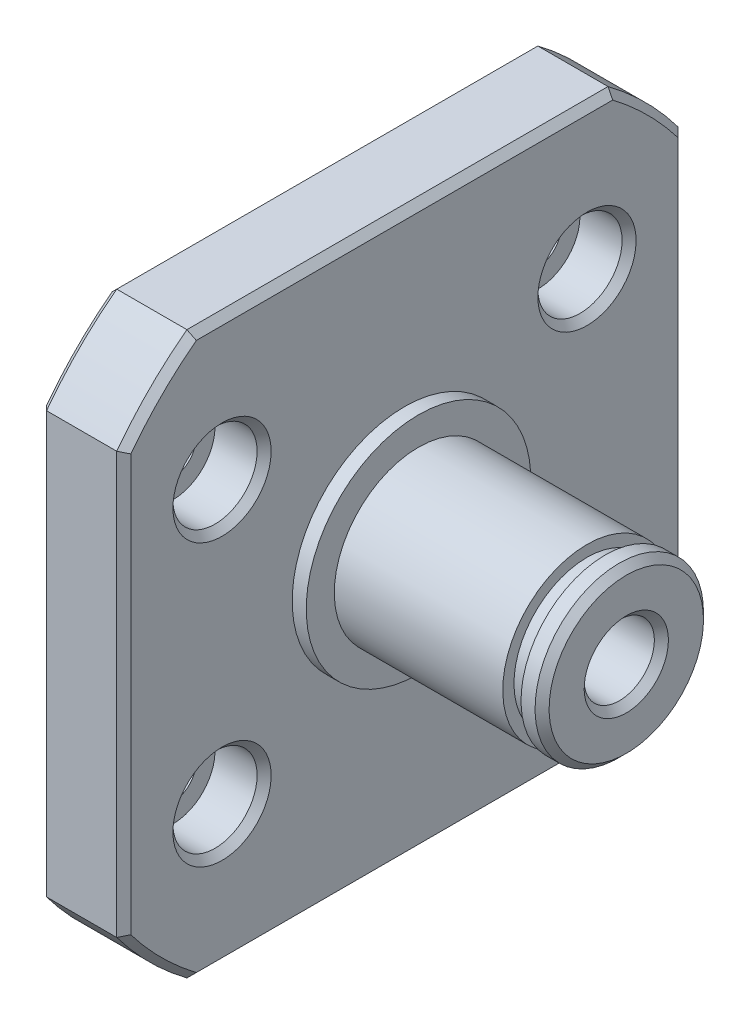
from build123d import *

# Parameters (mm, degrees)
SKETCH_5_R          = 1.65
CUT_EXTRUDE_6_DEPTH = 39.725185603
SKETCH_6_R          = 3
CUT_EXTRUDE_7_DEPTH = 3.5
CHAMFER_2_SIZE      = 0.5
CUT_EXTRUDE_8_DEPTH = 36.710502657


with BuildPart() as part:
    # Sketch 1 → Revolve 1 (revolve)
    with BuildSketch(Plane.XY):
        Polygon((0, 1.5), (0, 25), (6, 25), (6, 8), (7, 8), (7, 6), (19, 6), (19, 5.2), (20.3, 5.2), (20.3, 6), (21.8, 6), (21.8, 2.5), (16.8, 2.5), (16.8, 1.5), align=None)
    revolve(axis=Axis((15.775828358, 0, 0), (-1, 0, 0)))

    # Sketch 5 → Cut-Extrude 6 (cut, through all)
    with BuildSketch(Plane(origin=(6, 0, 0), x_dir=(0, 0, -1), z_dir=(1, 0, 0))):
        with Locations(Location((-13, 10, 0), (0, 0, 90))):
            Circle(SKETCH_5_R)
        with Locations(Location((-13, -10, 0), (0, 0, 90))):
            Circle(SKETCH_5_R)
        with Locations(Location((13, -10, 0), (0, 0, 90))):
            Circle(SKETCH_5_R)
        with Locations(Location((13, 10, 0), (0, 0, 90))):
            Circle(SKETCH_5_R)
        with BuildLine():
            Line((-15, 20), (15, 20))
            ThreePointArc((15, 20), (0, 25), (-15, 20))
        make_face()
        with BuildLine():
            Line((-20, 15), (-20, -15))
            ThreePointArc((-20, -15), (-25, 0), (-20, 15))
        make_face()
        with BuildLine():
            Line((-15, -20), (15, -20))
            ThreePointArc((15, -20), (0, -25), (-15, -20))
        make_face()
        with BuildLine():
            Line((20, 15), (20, -15))
            ThreePointArc((20, -15), (25, 0), (20, 15))
        make_face()
    extrude(amount=-CUT_EXTRUDE_6_DEPTH, mode=Mode.SUBTRACT)

    # Sketch 6 → Cut-Extrude 7 (cut)
    with BuildSketch(Plane(origin=(6, 0, 0), x_dir=(0, 0, -1), z_dir=(1, 0, 0))):
        with Locations(Location((-13, 10, 0), (0, 0, 90))):
            Circle(SKETCH_6_R)
        with Locations(Location((13, 10, 0), (0, 0, 90))):
            Circle(SKETCH_6_R)
        with Locations(Location((-13, -10, 0), (0, 0, 90))):
            Circle(SKETCH_6_R)
        with Locations(Location((13, -10, 0), (0, 0, 90))):
            Circle(SKETCH_6_R)
    extrude(amount=-CUT_EXTRUDE_7_DEPTH, mode=Mode.SUBTRACT)

    # Chamfer 2
    chamfer_2_edges = [part.edges().sort_by_distance(p)[0] for p in [
        (21.8, -2.5, 0),
        (21.8, -6, 0),
        (6, 17.67766953, 17.67766953),
        (0, -17.67766953, 17.67766953),
        (0, -17.67766953, -17.67766953),
        (0, 17.67766953, -17.67766953),
        (6, -17.67766953, 17.67766953),
        (6, -17.67766953, -17.67766953),
        (6, 17.67766953, -17.67766953),
        (0, 0, -20),
        (6, 0, -20),
        (0, 0, 20),
        (6, 0, 20),
        (0, 20, 0),
        (6, 20, 0),
        (0, 8.35, -13),
        (0, -20, 0),
        (6, -20, 0),
        (0, 8.35, 13),
        (0, -11.65, 13),
        (0, -11.65, -13),
        (6, 7, -13),
        (6, -13, 13),
        (6, -13, -13),
        (0, 17.67766953, 17.67766953),
        (6, 7, 13),
        (0, -1.5, 0),
    ]]
    chamfer(chamfer_2_edges, length=CHAMFER_2_SIZE)

    # Sketch 7 → Cut-Extrude 8 (cut, through all)
    with BuildSketch(Plane(origin=(21.8, 0, 0), x_dir=(0, 0, -1), z_dir=(1, 0, 0))):
        with BuildLine():
            Line((-2, 1.5), (2, 1.5))
            ThreePointArc((2, 1.5), (2.5, 0), (2, -1.5))
            Line((2, -1.5), (-2, -1.5))
            ThreePointArc((-2, -1.5), (-2.5, 0), (-2, 1.5))
        make_face()
    extrude(amount=-CUT_EXTRUDE_8_DEPTH, mode=Mode.SUBTRACT)


solid = part.part
